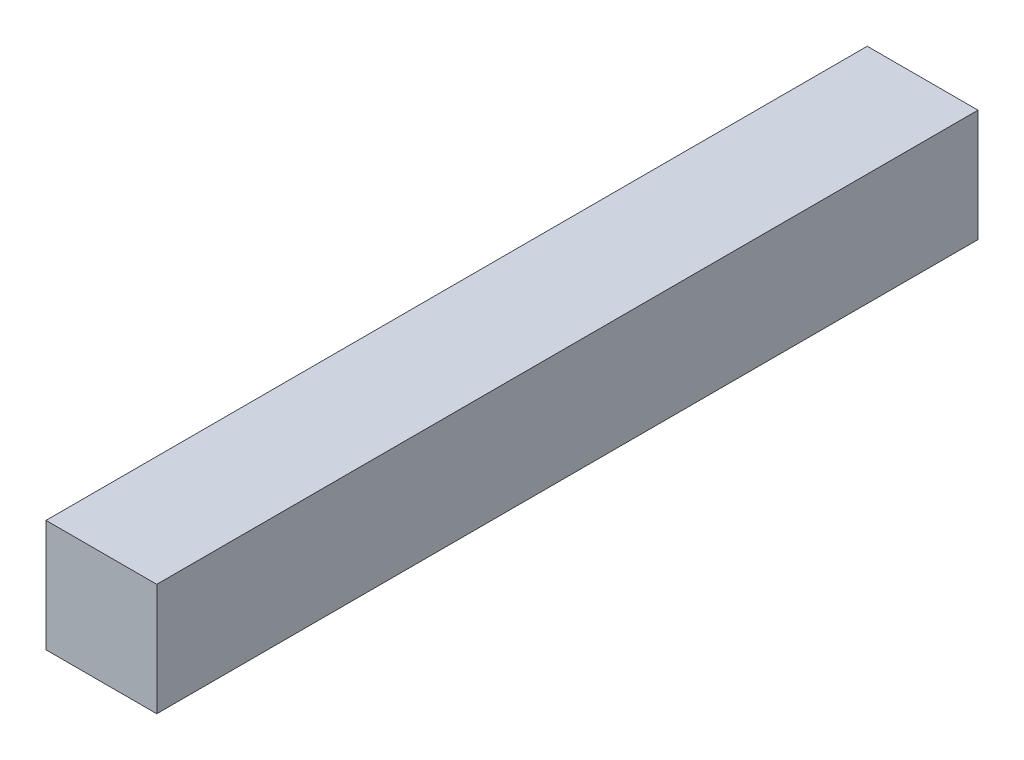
ISO-10303-21;
HEADER;
FILE_DESCRIPTION(('STEP AP214'),'2;1');
FILE_NAME('part.step','',(''),(''),'','','');
FILE_SCHEMA(('AUTOMOTIVE_DESIGN { 1 0 10303 214 1 1 1 1 }'));
ENDSEC;
DATA;
#1=APPLICATION_CONTEXT('core data for automotive mechanical design processes');
#2=APPLICATION_PROTOCOL_DEFINITION('international standard','automotive_design',2000,#1);
#3=PRODUCT_CONTEXT('',#1,'mechanical');
#4=PRODUCT('Part','Part','',(#3));
#5=PRODUCT_RELATED_PRODUCT_CATEGORY('part','',(#4));
#6=PRODUCT_DEFINITION_FORMATION('','',#4);
#7=PRODUCT_DEFINITION_CONTEXT('part definition',#1,'design');
#8=PRODUCT_DEFINITION('design','',#6,#7);
#9=PRODUCT_DEFINITION_SHAPE('','',#8);
#10=(LENGTH_UNIT() NAMED_UNIT(*) SI_UNIT(.MILLI.,.METRE.));
#11=(NAMED_UNIT(*) PLANE_ANGLE_UNIT() SI_UNIT($,.RADIAN.));
#12=(NAMED_UNIT(*) SI_UNIT($,.STERADIAN.) SOLID_ANGLE_UNIT());
#13=UNCERTAINTY_MEASURE_WITH_UNIT(LENGTH_MEASURE(1.E-05),#10,'distance_accuracy_value','');
#14=(GEOMETRIC_REPRESENTATION_CONTEXT(3) GLOBAL_UNCERTAINTY_ASSIGNED_CONTEXT((#13)) GLOBAL_UNIT_ASSIGNED_CONTEXT((#10,
#11,#12)) REPRESENTATION_CONTEXT('',''));
#15=CARTESIAN_POINT('',(0.,0.,0.));
#16=DIRECTION('',(0.,0.,1.));
#17=DIRECTION('',(1.,0.,0.));
#18=AXIS2_PLACEMENT_3D('',#15,#16,#17);
#19=CARTESIAN_POINT('',(2.9972,-3.03405081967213,44.45));
#20=DIRECTION('',(-1.,0.,0.));
#21=DIRECTION('',(0.,0.,1.));
#22=AXIS2_PLACEMENT_3D('',#19,#20,#21);
#23=PLANE('',#22);
#24=DIRECTION('',(0.,1.,0.));
#25=VECTOR('',#24,1.);
#26=CARTESIAN_POINT('',(2.9972,-3.03405081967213,0.));
#27=LINE('',#26,#25);
#28=CARTESIAN_POINT('',(2.9972,-3.03405081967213,0.));
#29=VERTEX_POINT('',#28);
#30=CARTESIAN_POINT('',(2.9972,3.03405081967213,0.));
#31=VERTEX_POINT('',#30);
#32=EDGE_CURVE('E107',#29,#31,#27,.T.);
#33=ORIENTED_EDGE('',*,*,#32,.T.);
#34=DIRECTION('',(0.,0.,-1.));
#35=VECTOR('',#34,1.);
#36=CARTESIAN_POINT('',(2.9972,3.03405081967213,44.45));
#37=LINE('',#36,#35);
#38=CARTESIAN_POINT('',(2.9972,3.03405081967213,44.45));
#39=VERTEX_POINT('',#38);
#40=EDGE_CURVE('E11',#39,#31,#37,.T.);
#41=ORIENTED_EDGE('',*,*,#40,.F.);
#42=DIRECTION('',(0.,1.,0.));
#43=VECTOR('',#42,1.);
#44=CARTESIAN_POINT('',(2.9972,-3.03405081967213,44.45));
#45=LINE('',#44,#43);
#46=CARTESIAN_POINT('',(2.9972,-3.03405081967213,44.45));
#47=VERTEX_POINT('',#46);
#48=EDGE_CURVE('E91',#47,#39,#45,.T.);
#49=ORIENTED_EDGE('',*,*,#48,.F.);
#50=DIRECTION('',(0.,0.,-1.));
#51=VECTOR('',#50,1.);
#52=CARTESIAN_POINT('',(2.9972,-3.03405081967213,44.45));
#53=LINE('',#52,#51);
#54=EDGE_CURVE('E103',#47,#29,#53,.T.);
#55=ORIENTED_EDGE('',*,*,#54,.T.);
#56=EDGE_LOOP('',(#33,#41,#49,#55));
#57=FACE_BOUND('',#56,.T.);
#58=ADVANCED_FACE('F39',(#57),#23,.F.);
#59=CARTESIAN_POINT('',(-2.9972,3.03405081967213,44.45));
#60=DIRECTION('',(0.,-1.,0.));
#61=DIRECTION('',(0.,0.,-1.));
#62=AXIS2_PLACEMENT_3D('',#59,#60,#61);
#63=PLANE('',#62);
#64=DIRECTION('',(-1.,0.,0.));
#65=VECTOR('',#64,1.);
#66=CARTESIAN_POINT('',(-2.9972,3.03405081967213,0.));
#67=LINE('',#66,#65);
#68=CARTESIAN_POINT('',(-2.9972,3.03405081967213,0.));
#69=VERTEX_POINT('',#68);
#70=EDGE_CURVE('E96',#31,#69,#67,.T.);
#71=ORIENTED_EDGE('',*,*,#70,.T.);
#72=DIRECTION('',(0.,0.,-1.));
#73=VECTOR('',#72,1.);
#74=CARTESIAN_POINT('',(-2.9972,3.03405081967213,44.45));
#75=LINE('',#74,#73);
#76=CARTESIAN_POINT('',(-2.9972,3.03405081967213,44.45));
#77=VERTEX_POINT('',#76);
#78=EDGE_CURVE('E48',#77,#69,#75,.T.);
#79=ORIENTED_EDGE('',*,*,#78,.F.);
#80=DIRECTION('',(-1.,0.,0.));
#81=VECTOR('',#80,1.);
#82=CARTESIAN_POINT('',(-2.9972,3.03405081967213,44.45));
#83=LINE('',#82,#81);
#84=EDGE_CURVE('E86',#39,#77,#83,.T.);
#85=ORIENTED_EDGE('',*,*,#84,.F.);
#86=ORIENTED_EDGE('',*,*,#40,.T.);
#87=EDGE_LOOP('',(#71,#79,#85,#86));
#88=FACE_BOUND('',#87,.T.);
#89=ADVANCED_FACE('F95',(#88),#63,.F.);
#90=CARTESIAN_POINT('',(-2.9972,-3.03405081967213,44.45));
#91=DIRECTION('',(1.,0.,0.));
#92=DIRECTION('',(0.,0.,-1.));
#93=AXIS2_PLACEMENT_3D('',#90,#91,#92);
#94=PLANE('',#93);
#95=DIRECTION('',(0.,-1.,0.));
#96=VECTOR('',#95,1.);
#97=CARTESIAN_POINT('',(-2.9972,-3.03405081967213,0.));
#98=LINE('',#97,#96);
#99=CARTESIAN_POINT('',(-2.9972,-3.03405081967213,0.));
#100=VERTEX_POINT('',#99);
#101=EDGE_CURVE('E73',#69,#100,#98,.T.);
#102=ORIENTED_EDGE('',*,*,#101,.T.);
#103=DIRECTION('',(0.,0.,-1.));
#104=VECTOR('',#103,1.);
#105=CARTESIAN_POINT('',(-2.9972,-3.03405081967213,44.45));
#106=LINE('',#105,#104);
#107=CARTESIAN_POINT('',(-2.9972,-3.03405081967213,44.45));
#108=VERTEX_POINT('',#107);
#109=EDGE_CURVE('E98',#108,#100,#106,.T.);
#110=ORIENTED_EDGE('',*,*,#109,.F.);
#111=DIRECTION('',(0.,-1.,0.));
#112=VECTOR('',#111,1.);
#113=CARTESIAN_POINT('',(-2.9972,-3.03405081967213,44.45));
#114=LINE('',#113,#112);
#115=EDGE_CURVE('E89',#77,#108,#114,.T.);
#116=ORIENTED_EDGE('',*,*,#115,.F.);
#117=ORIENTED_EDGE('',*,*,#78,.T.);
#118=EDGE_LOOP('',(#102,#110,#116,#117));
#119=FACE_BOUND('',#118,.T.);
#120=ADVANCED_FACE('F99',(#119),#94,.F.);
#121=CARTESIAN_POINT('',(-2.9972,-3.03405081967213,44.45));
#122=DIRECTION('',(0.,1.,0.));
#123=DIRECTION('',(0.,0.,1.));
#124=AXIS2_PLACEMENT_3D('',#121,#122,#123);
#125=PLANE('',#124);
#126=DIRECTION('',(1.,0.,0.));
#127=VECTOR('',#126,1.);
#128=CARTESIAN_POINT('',(-2.9972,-3.03405081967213,0.));
#129=LINE('',#128,#127);
#130=EDGE_CURVE('E79',#100,#29,#129,.T.);
#131=ORIENTED_EDGE('',*,*,#130,.T.);
#132=ORIENTED_EDGE('',*,*,#54,.F.);
#133=DIRECTION('',(1.,0.,0.));
#134=VECTOR('',#133,1.);
#135=CARTESIAN_POINT('',(-2.9972,-3.03405081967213,44.45));
#136=LINE('',#135,#134);
#137=EDGE_CURVE('E56',#108,#47,#136,.T.);
#138=ORIENTED_EDGE('',*,*,#137,.F.);
#139=ORIENTED_EDGE('',*,*,#109,.T.);
#140=EDGE_LOOP('',(#131,#132,#138,#139));
#141=FACE_BOUND('',#140,.T.);
#142=ADVANCED_FACE('F120',(#141),#125,.F.);
#143=CARTESIAN_POINT('',(0.,0.,44.45));
#144=DIRECTION('',(0.,0.,-1.));
#145=DIRECTION('',(-1.,0.,0.));
#146=AXIS2_PLACEMENT_3D('',#143,#144,#145);
#147=PLANE('',#146);
#148=ORIENTED_EDGE('',*,*,#48,.T.);
#149=ORIENTED_EDGE('',*,*,#84,.T.);
#150=ORIENTED_EDGE('',*,*,#115,.T.);
#151=ORIENTED_EDGE('',*,*,#137,.T.);
#152=EDGE_LOOP('',(#148,#149,#150,#151));
#153=FACE_BOUND('',#152,.T.);
#154=ADVANCED_FACE('F87',(#153),#147,.F.);
#155=CARTESIAN_POINT('',(0.,0.,0.));
#156=DIRECTION('',(0.,0.,-1.));
#157=DIRECTION('',(-1.,0.,0.));
#158=AXIS2_PLACEMENT_3D('',#155,#156,#157);
#159=PLANE('',#158);
#160=ORIENTED_EDGE('',*,*,#32,.F.);
#161=ORIENTED_EDGE('',*,*,#130,.F.);
#162=ORIENTED_EDGE('',*,*,#101,.F.);
#163=ORIENTED_EDGE('',*,*,#70,.F.);
#164=EDGE_LOOP('',(#160,#161,#162,#163));
#165=FACE_BOUND('',#164,.T.);
#166=ADVANCED_FACE('F123',(#165),#159,.T.);
#167=CLOSED_SHELL('',(#58,#89,#120,#142,#154,#166));
#168=MANIFOLD_SOLID_BREP('B2',#167);
#169=ADVANCED_BREP_SHAPE_REPRESENTATION('',(#18,#168),#14);
#170=SHAPE_DEFINITION_REPRESENTATION(#9,#169);
ENDSEC;
END-ISO-10303-21;
